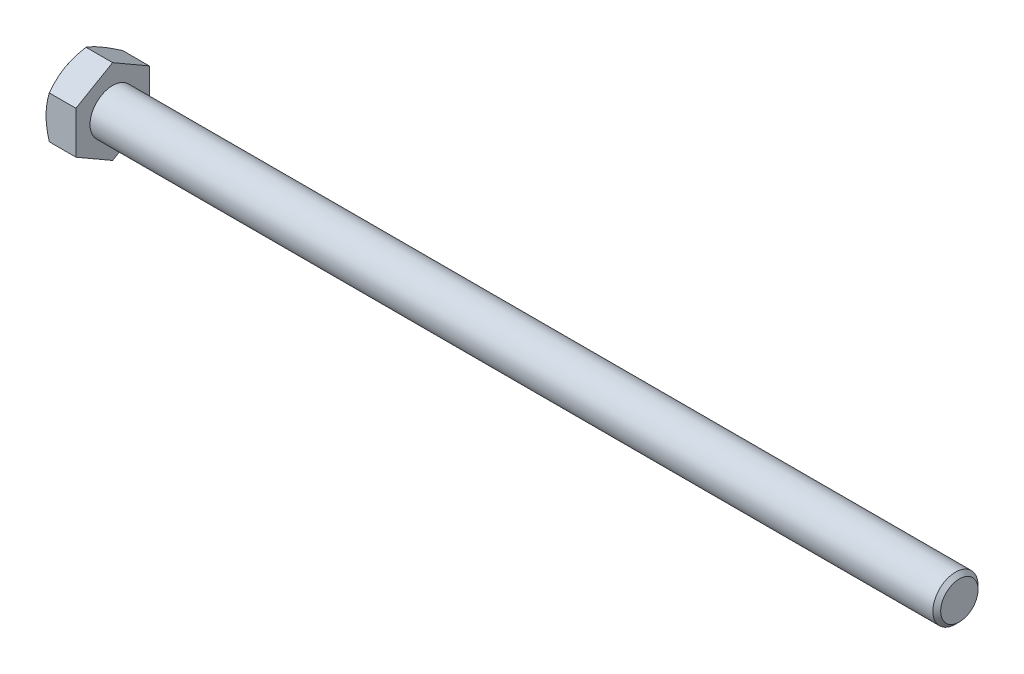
from build123d import *

# Parameters (mm, degrees)
BASEHEAD_DEPTH = 5.3


with BuildPart() as part:
    # Sketch1 → BaseHead (new body)
    with BuildSketch(Plane(origin=(0, 0, 0), x_dir=(0, 0, -1), z_dir=(1, 0, 0))):
        Polygon((6.5, 3.75277675), (6.5, -3.75277675), (0, -7.505553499), (-6.5, -3.75277675), (-6.5, 3.75277675), (0, 7.505553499), align=None)
    extrude(amount=BASEHEAD_DEPTH)

    # BodySke → BaseBody (revolve)
    with BuildSketch(Plane.XY, mode=Mode.PRIVATE) as basebody_sk:
        Polygon((0, 0), (155.3, 0), (155.3, 3.3095), (154.6095, 4), (0, 4), align=None)
    revolve(basebody_sk.sketch.rotate(Axis((0, 0, 0), (1, 0, 0)), 90), axis=Axis((0, 0, 0), (1, 0, 0)))

    # Sketch3 → HeadChamfer (revolve, cut)
    with BuildSketch(Plane.XY):
        Polygon((0, 6.5), (3.46730793, 12.505553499), (3.46730793, 17.505553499), (-10, 17.505553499), (-10, 6.5), align=None)
    revolve(axis=Axis((0, 0, 0), (1, 0, 0)), mode=Mode.SUBTRACT)


solid = part.part
